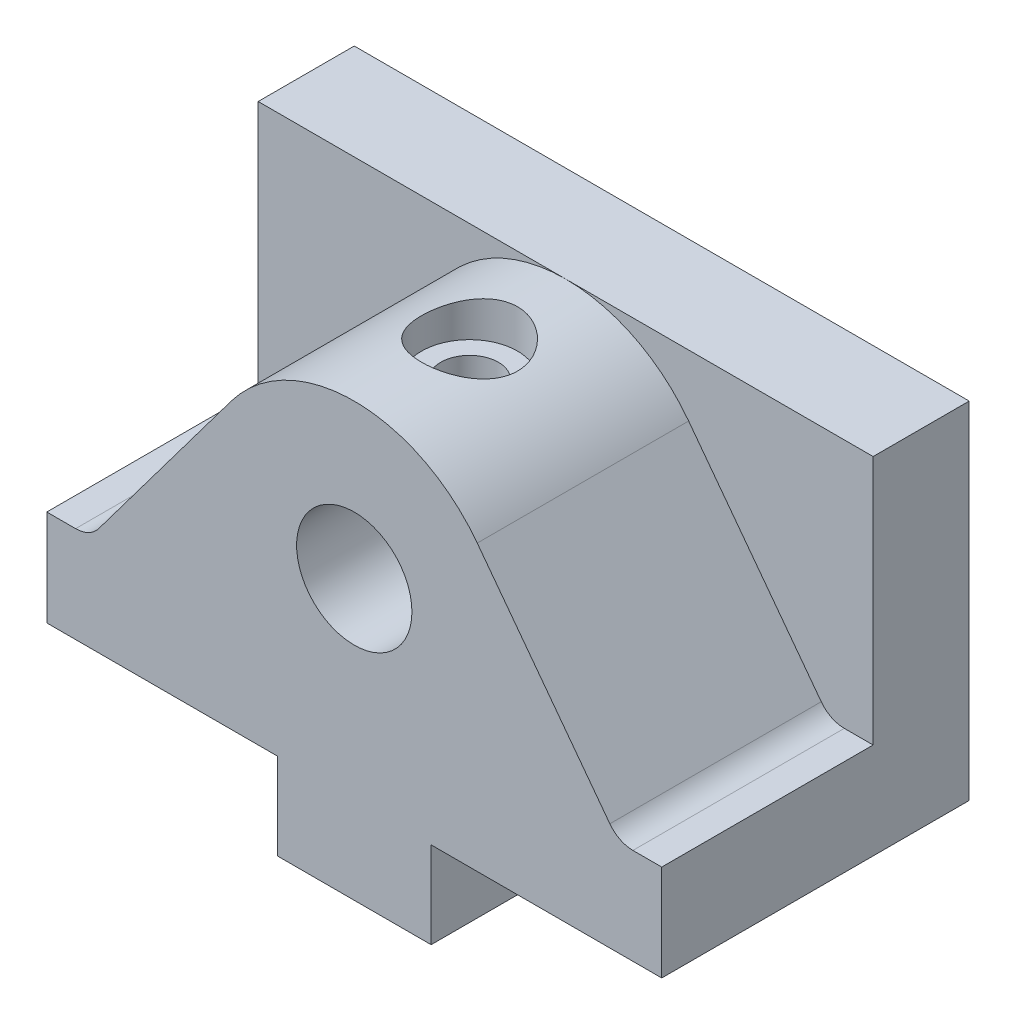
ISO-10303-21;
HEADER;
FILE_DESCRIPTION(('STEP AP214'),'2;1');
FILE_NAME('part.step','',(''),(''),'','','');
FILE_SCHEMA(('AUTOMOTIVE_DESIGN { 1 0 10303 214 1 1 1 1 }'));
ENDSEC;
DATA;
#1=APPLICATION_CONTEXT('core data for automotive mechanical design processes');
#2=APPLICATION_PROTOCOL_DEFINITION('international standard','automotive_design',2000,#1);
#3=PRODUCT_CONTEXT('',#1,'mechanical');
#4=PRODUCT('Part','Part','',(#3));
#5=PRODUCT_RELATED_PRODUCT_CATEGORY('part','',(#4));
#6=PRODUCT_DEFINITION_FORMATION('','',#4);
#7=PRODUCT_DEFINITION_CONTEXT('part definition',#1,'design');
#8=PRODUCT_DEFINITION('design','',#6,#7);
#9=PRODUCT_DEFINITION_SHAPE('','',#8);
#10=(LENGTH_UNIT() NAMED_UNIT(*) SI_UNIT(.MILLI.,.METRE.));
#11=(NAMED_UNIT(*) PLANE_ANGLE_UNIT() SI_UNIT($,.RADIAN.));
#12=(NAMED_UNIT(*) SI_UNIT($,.STERADIAN.) SOLID_ANGLE_UNIT());
#13=UNCERTAINTY_MEASURE_WITH_UNIT(LENGTH_MEASURE(1.E-05),#10,'distance_accuracy_value','');
#14=(GEOMETRIC_REPRESENTATION_CONTEXT(3) GLOBAL_UNCERTAINTY_ASSIGNED_CONTEXT((#13)) GLOBAL_UNIT_ASSIGNED_CONTEXT((#10,
#11,#12)) REPRESENTATION_CONTEXT('',''));
#15=CARTESIAN_POINT('',(0.,0.,0.));
#16=DIRECTION('',(0.,0.,1.));
#17=DIRECTION('',(1.,0.,0.));
#18=AXIS2_PLACEMENT_3D('',#15,#16,#17);
#19=CARTESIAN_POINT('',(8.00000000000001,-23.,32.));
#20=DIRECTION('',(0.,1.,0.));
#21=DIRECTION('',(-1.,0.,0.));
#22=AXIS2_PLACEMENT_3D('',#19,#20,#21);
#23=PLANE('',#22);
#24=CARTESIAN_POINT('',(0.,-23.,24.));
#25=DIRECTION('',(0.,1.,0.));
#26=DIRECTION('',(-1.,0.,0.));
#27=AXIS2_PLACEMENT_3D('',#24,#25,#26);
#28=CIRCLE('',#27,3.);
#29=CARTESIAN_POINT('',(-2.99999999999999,-23.,24.));
#30=VERTEX_POINT('',#29);
#31=EDGE_CURVE('E180',#30,#30,#28,.T.);
#32=ORIENTED_EDGE('',*,*,#31,.T.);
#33=EDGE_LOOP('',(#32));
#34=FACE_BOUND('',#33,.T.);
#35=DIRECTION('',(1.,0.,0.));
#36=VECTOR('',#35,1.);
#37=CARTESIAN_POINT('',(8.00000000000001,-23.,0.));
#38=LINE('',#37,#36);
#39=CARTESIAN_POINT('',(-7.99999999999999,-23.,0.));
#40=VERTEX_POINT('',#39);
#41=CARTESIAN_POINT('',(8.00000000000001,-23.,0.));
#42=VERTEX_POINT('',#41);
#43=EDGE_CURVE('E369',#40,#42,#38,.T.);
#44=ORIENTED_EDGE('',*,*,#43,.T.);
#45=DIRECTION('',(0.,0.,-1.));
#46=VECTOR('',#45,1.);
#47=CARTESIAN_POINT('',(8.00000000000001,-23.,32.));
#48=LINE('',#47,#46);
#49=CARTESIAN_POINT('',(8.00000000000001,-23.,32.));
#50=VERTEX_POINT('',#49);
#51=EDGE_CURVE('E379',#50,#42,#48,.T.);
#52=ORIENTED_EDGE('',*,*,#51,.F.);
#53=DIRECTION('',(1.,0.,0.));
#54=VECTOR('',#53,1.);
#55=CARTESIAN_POINT('',(8.00000000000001,-23.,32.));
#56=LINE('',#55,#54);
#57=CARTESIAN_POINT('',(-7.99999999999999,-23.,32.));
#58=VERTEX_POINT('',#57);
#59=EDGE_CURVE('E351',#58,#50,#56,.T.);
#60=ORIENTED_EDGE('',*,*,#59,.F.);
#61=DIRECTION('',(0.,0.,-1.));
#62=VECTOR('',#61,1.);
#63=CARTESIAN_POINT('',(-7.99999999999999,-23.,32.));
#64=LINE('',#63,#62);
#65=EDGE_CURVE('E382',#58,#40,#64,.T.);
#66=ORIENTED_EDGE('',*,*,#65,.T.);
#67=EDGE_LOOP('',(#44,#52,#60,#66));
#68=FACE_BOUND('',#67,.T.);
#69=CARTESIAN_POINT('',(0.,-23.,8.));
#70=DIRECTION('',(0.,1.,0.));
#71=DIRECTION('',(-1.,0.,0.));
#72=AXIS2_PLACEMENT_3D('',#69,#70,#71);
#73=CIRCLE('',#72,3.);
#74=CARTESIAN_POINT('',(-2.99999999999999,-23.,8.));
#75=VERTEX_POINT('',#74);
#76=EDGE_CURVE('E172',#75,#75,#73,.T.);
#77=ORIENTED_EDGE('',*,*,#76,.T.);
#78=EDGE_LOOP('',(#77));
#79=FACE_BOUND('',#78,.T.);
#80=ADVANCED_FACE('F32',(#34,#68,#79),#23,.F.);
#81=CARTESIAN_POINT('',(32.,22.,32.));
#82=DIRECTION('',(-1.,0.,0.));
#83=DIRECTION('',(0.,-1.,0.));
#84=AXIS2_PLACEMENT_3D('',#81,#82,#83);
#85=PLANE('',#84);
#86=DIRECTION('',(0.,-1.,0.));
#87=VECTOR('',#86,1.);
#88=CARTESIAN_POINT('',(32.,22.,10.));
#89=LINE('',#88,#87);
#90=CARTESIAN_POINT('',(32.,22.,10.));
#91=VERTEX_POINT('',#90);
#92=CARTESIAN_POINT('',(32.,-4.,10.));
#93=VERTEX_POINT('',#92);
#94=EDGE_CURVE('E337',#91,#93,#89,.T.);
#95=ORIENTED_EDGE('',*,*,#94,.T.);
#96=DIRECTION('',(0.,0.,1.));
#97=VECTOR('',#96,1.);
#98=CARTESIAN_POINT('',(32.,-4.,32.));
#99=LINE('',#98,#97);
#100=CARTESIAN_POINT('',(32.,-4.,32.));
#101=VERTEX_POINT('',#100);
#102=EDGE_CURVE('E324',#93,#101,#99,.T.);
#103=ORIENTED_EDGE('',*,*,#102,.T.);
#104=DIRECTION('',(0.,1.,0.));
#105=VECTOR('',#104,1.);
#106=CARTESIAN_POINT('',(32.,22.,32.));
#107=LINE('',#106,#105);
#108=CARTESIAN_POINT('',(32.,-14.,32.));
#109=VERTEX_POINT('',#108);
#110=EDGE_CURVE('E341',#109,#101,#107,.T.);
#111=ORIENTED_EDGE('',*,*,#110,.F.);
#112=DIRECTION('',(0.,0.,-1.));
#113=VECTOR('',#112,1.);
#114=CARTESIAN_POINT('',(32.,-14.,32.));
#115=LINE('',#114,#113);
#116=CARTESIAN_POINT('',(32.,-14.,0.));
#117=VERTEX_POINT('',#116);
#118=EDGE_CURVE('E357',#109,#117,#115,.T.);
#119=ORIENTED_EDGE('',*,*,#118,.T.);
#120=DIRECTION('',(0.,1.,0.));
#121=VECTOR('',#120,1.);
#122=CARTESIAN_POINT('',(32.,22.,0.));
#123=LINE('',#122,#121);
#124=CARTESIAN_POINT('',(32.,22.,0.));
#125=VERTEX_POINT('',#124);
#126=EDGE_CURVE('E340',#117,#125,#123,.T.);
#127=ORIENTED_EDGE('',*,*,#126,.T.);
#128=DIRECTION('',(0.,0.,-1.));
#129=VECTOR('',#128,1.);
#130=CARTESIAN_POINT('',(32.,22.,32.));
#131=LINE('',#130,#129);
#132=EDGE_CURVE('E393',#91,#125,#131,.T.);
#133=ORIENTED_EDGE('',*,*,#132,.F.);
#134=EDGE_LOOP('',(#95,#103,#111,#119,#127,#133));
#135=FACE_BOUND('',#134,.T.);
#136=ADVANCED_FACE('F228',(#135),#85,.F.);
#137=CARTESIAN_POINT('',(-32.,22.,32.));
#138=DIRECTION('',(0.,-1.,0.));
#139=DIRECTION('',(1.,0.,0.));
#140=AXIS2_PLACEMENT_3D('',#137,#138,#139);
#141=PLANE('',#140);
#142=DIRECTION('',(0.,0.,-1.));
#143=VECTOR('',#142,1.);
#144=CARTESIAN_POINT('',(-32.,22.,32.));
#145=LINE('',#144,#143);
#146=CARTESIAN_POINT('',(-32.,22.,10.));
#147=VERTEX_POINT('',#146);
#148=CARTESIAN_POINT('',(-32.,22.,0.));
#149=VERTEX_POINT('',#148);
#150=EDGE_CURVE('E391',#147,#149,#145,.T.);
#151=ORIENTED_EDGE('',*,*,#150,.F.);
#152=DIRECTION('',(1.,0.,0.));
#153=VECTOR('',#152,1.);
#154=CARTESIAN_POINT('',(-32.,22.,10.));
#155=LINE('',#154,#153);
#156=CARTESIAN_POINT('',(0.,22.,10.));
#157=VERTEX_POINT('',#156);
#158=EDGE_CURVE('E333',#147,#157,#155,.T.);
#159=ORIENTED_EDGE('',*,*,#158,.T.);
#160=EDGE_CURVE('E336',#157,#91,#155,.T.);
#161=ORIENTED_EDGE('',*,*,#160,.T.);
#162=ORIENTED_EDGE('',*,*,#132,.T.);
#163=DIRECTION('',(-1.,0.,0.));
#164=VECTOR('',#163,1.);
#165=CARTESIAN_POINT('',(-32.,22.,0.));
#166=LINE('',#165,#164);
#167=EDGE_CURVE('E360',#125,#149,#166,.T.);
#168=ORIENTED_EDGE('',*,*,#167,.T.);
#169=EDGE_LOOP('',(#151,#159,#161,#162,#168));
#170=FACE_BOUND('',#169,.T.);
#171=ADVANCED_FACE('F234',(#170),#141,.F.);
#172=CARTESIAN_POINT('',(-32.,22.,32.));
#173=DIRECTION('',(1.,0.,0.));
#174=DIRECTION('',(0.,1.,0.));
#175=AXIS2_PLACEMENT_3D('',#172,#173,#174);
#176=PLANE('',#175);
#177=DIRECTION('',(0.,-1.,0.));
#178=VECTOR('',#177,1.);
#179=CARTESIAN_POINT('',(-32.,22.,32.));
#180=LINE('',#179,#178);
#181=CARTESIAN_POINT('',(-32.,-4.,32.));
#182=VERTEX_POINT('',#181);
#183=CARTESIAN_POINT('',(-32.,-14.,32.));
#184=VERTEX_POINT('',#183);
#185=EDGE_CURVE('E344',#182,#184,#180,.T.);
#186=ORIENTED_EDGE('',*,*,#185,.F.);
#187=DIRECTION('',(0.,0.,-1.));
#188=VECTOR('',#187,1.);
#189=CARTESIAN_POINT('',(-32.,-4.,32.));
#190=LINE('',#189,#188);
#191=CARTESIAN_POINT('',(-32.,-4.,10.));
#192=VERTEX_POINT('',#191);
#193=EDGE_CURVE('E330',#182,#192,#190,.T.);
#194=ORIENTED_EDGE('',*,*,#193,.T.);
#195=DIRECTION('',(0.,1.,0.));
#196=VECTOR('',#195,1.);
#197=CARTESIAN_POINT('',(-32.,22.,10.));
#198=LINE('',#197,#196);
#199=EDGE_CURVE('E398',#192,#147,#198,.T.);
#200=ORIENTED_EDGE('',*,*,#199,.T.);
#201=ORIENTED_EDGE('',*,*,#150,.T.);
#202=DIRECTION('',(0.,-1.,0.));
#203=VECTOR('',#202,1.);
#204=CARTESIAN_POINT('',(-32.,22.,0.));
#205=LINE('',#204,#203);
#206=CARTESIAN_POINT('',(-32.,-14.,0.));
#207=VERTEX_POINT('',#206);
#208=EDGE_CURVE('E363',#149,#207,#205,.T.);
#209=ORIENTED_EDGE('',*,*,#208,.T.);
#210=DIRECTION('',(0.,0.,-1.));
#211=VECTOR('',#210,1.);
#212=CARTESIAN_POINT('',(-32.,-14.,32.));
#213=LINE('',#212,#211);
#214=EDGE_CURVE('E388',#184,#207,#213,.T.);
#215=ORIENTED_EDGE('',*,*,#214,.F.);
#216=EDGE_LOOP('',(#186,#194,#200,#201,#209,#215));
#217=FACE_BOUND('',#216,.T.);
#218=ADVANCED_FACE('F249',(#217),#176,.F.);
#219=CARTESIAN_POINT('',(-32.,-14.,32.));
#220=DIRECTION('',(0.,1.,0.));
#221=DIRECTION('',(-1.,0.,0.));
#222=AXIS2_PLACEMENT_3D('',#219,#220,#221);
#223=PLANE('',#222);
#224=DIRECTION('',(1.,0.,0.));
#225=VECTOR('',#224,1.);
#226=CARTESIAN_POINT('',(-32.,-14.,0.));
#227=LINE('',#226,#225);
#228=CARTESIAN_POINT('',(-7.99999999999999,-14.,0.));
#229=VERTEX_POINT('',#228);
#230=EDGE_CURVE('E365',#207,#229,#227,.T.);
#231=ORIENTED_EDGE('',*,*,#230,.T.);
#232=DIRECTION('',(0.,0.,-1.));
#233=VECTOR('',#232,1.);
#234=CARTESIAN_POINT('',(-7.99999999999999,-14.,32.));
#235=LINE('',#234,#233);
#236=CARTESIAN_POINT('',(-7.99999999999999,-14.,32.));
#237=VERTEX_POINT('',#236);
#238=EDGE_CURVE('E385',#237,#229,#235,.T.);
#239=ORIENTED_EDGE('',*,*,#238,.F.);
#240=DIRECTION('',(1.,0.,0.));
#241=VECTOR('',#240,1.);
#242=CARTESIAN_POINT('',(-32.,-14.,32.));
#243=LINE('',#242,#241);
#244=EDGE_CURVE('E347',#184,#237,#243,.T.);
#245=ORIENTED_EDGE('',*,*,#244,.F.);
#246=ORIENTED_EDGE('',*,*,#214,.T.);
#247=EDGE_LOOP('',(#231,#239,#245,#246));
#248=FACE_BOUND('',#247,.T.);
#249=ADVANCED_FACE('F245',(#248),#223,.F.);
#250=CARTESIAN_POINT('',(-7.99999999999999,-14.,32.));
#251=DIRECTION('',(1.,0.,0.));
#252=DIRECTION('',(0.,1.,0.));
#253=AXIS2_PLACEMENT_3D('',#250,#251,#252);
#254=PLANE('',#253);
#255=DIRECTION('',(0.,-1.,0.));
#256=VECTOR('',#255,1.);
#257=CARTESIAN_POINT('',(-7.99999999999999,-14.,0.));
#258=LINE('',#257,#256);
#259=EDGE_CURVE('E367',#229,#40,#258,.T.);
#260=ORIENTED_EDGE('',*,*,#259,.T.);
#261=ORIENTED_EDGE('',*,*,#65,.F.);
#262=DIRECTION('',(0.,-1.,0.));
#263=VECTOR('',#262,1.);
#264=CARTESIAN_POINT('',(-7.99999999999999,-14.,32.));
#265=LINE('',#264,#263);
#266=EDGE_CURVE('E349',#237,#58,#265,.T.);
#267=ORIENTED_EDGE('',*,*,#266,.F.);
#268=ORIENTED_EDGE('',*,*,#238,.T.);
#269=EDGE_LOOP('',(#260,#261,#267,#268));
#270=FACE_BOUND('',#269,.T.);
#271=ADVANCED_FACE('F242',(#270),#254,.F.);
#272=CARTESIAN_POINT('',(8.00000000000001,-14.,32.));
#273=DIRECTION('',(-1.,0.,0.));
#274=DIRECTION('',(0.,-1.,0.));
#275=AXIS2_PLACEMENT_3D('',#272,#273,#274);
#276=PLANE('',#275);
#277=DIRECTION('',(0.,1.,0.));
#278=VECTOR('',#277,1.);
#279=CARTESIAN_POINT('',(8.00000000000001,-14.,0.));
#280=LINE('',#279,#278);
#281=CARTESIAN_POINT('',(8.00000000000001,-14.,0.));
#282=VERTEX_POINT('',#281);
#283=EDGE_CURVE('E371',#42,#282,#280,.T.);
#284=ORIENTED_EDGE('',*,*,#283,.T.);
#285=DIRECTION('',(0.,0.,-1.));
#286=VECTOR('',#285,1.);
#287=CARTESIAN_POINT('',(8.00000000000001,-14.,32.));
#288=LINE('',#287,#286);
#289=CARTESIAN_POINT('',(8.00000000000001,-14.,32.));
#290=VERTEX_POINT('',#289);
#291=EDGE_CURVE('E376',#290,#282,#288,.T.);
#292=ORIENTED_EDGE('',*,*,#291,.F.);
#293=DIRECTION('',(0.,1.,0.));
#294=VECTOR('',#293,1.);
#295=CARTESIAN_POINT('',(8.00000000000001,-14.,32.));
#296=LINE('',#295,#294);
#297=EDGE_CURVE('E353',#50,#290,#296,.T.);
#298=ORIENTED_EDGE('',*,*,#297,.F.);
#299=ORIENTED_EDGE('',*,*,#51,.T.);
#300=EDGE_LOOP('',(#284,#292,#298,#299));
#301=FACE_BOUND('',#300,.T.);
#302=ADVANCED_FACE('F240',(#301),#276,.F.);
#303=CARTESIAN_POINT('',(32.,-14.,32.));
#304=DIRECTION('',(0.,1.,0.));
#305=DIRECTION('',(-1.,0.,0.));
#306=AXIS2_PLACEMENT_3D('',#303,#304,#305);
#307=PLANE('',#306);
#308=DIRECTION('',(1.,0.,0.));
#309=VECTOR('',#308,1.);
#310=CARTESIAN_POINT('',(32.,-14.,0.));
#311=LINE('',#310,#309);
#312=EDGE_CURVE('E345',#282,#117,#311,.T.);
#313=ORIENTED_EDGE('',*,*,#312,.T.);
#314=ORIENTED_EDGE('',*,*,#118,.F.);
#315=DIRECTION('',(1.,0.,0.));
#316=VECTOR('',#315,1.);
#317=CARTESIAN_POINT('',(32.,-14.,32.));
#318=LINE('',#317,#316);
#319=EDGE_CURVE('E355',#290,#109,#318,.T.);
#320=ORIENTED_EDGE('',*,*,#319,.F.);
#321=ORIENTED_EDGE('',*,*,#291,.T.);
#322=EDGE_LOOP('',(#313,#314,#320,#321));
#323=FACE_BOUND('',#322,.T.);
#324=ADVANCED_FACE('F305',(#323),#307,.F.);
#325=CARTESIAN_POINT('',(32.,-23.,32.));
#326=DIRECTION('',(0.,0.,-1.));
#327=DIRECTION('',(-1.,0.,0.));
#328=AXIS2_PLACEMENT_3D('',#325,#326,#327);
#329=PLANE('',#328);
#330=CARTESIAN_POINT('',(0.,6.,32.));
#331=DIRECTION('',(0.,0.,1.));
#332=DIRECTION('',(1.,0.,0.));
#333=AXIS2_PLACEMENT_3D('',#330,#331,#332);
#334=CIRCLE('',#333,6.);
#335=CARTESIAN_POINT('',(6.,6.,32.));
#336=VERTEX_POINT('',#335);
#337=EDGE_CURVE('E197',#336,#336,#334,.T.);
#338=ORIENTED_EDGE('',*,*,#337,.F.);
#339=EDGE_LOOP('',(#338));
#340=FACE_BOUND('',#339,.T.);
#341=DIRECTION('',(0.6,0.8,0.));
#342=VECTOR('',#341,1.);
#343=CARTESIAN_POINT('',(-12.8,15.6,32.));
#344=LINE('',#343,#342);
#345=CARTESIAN_POINT('',(-26.6,-2.80000000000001,32.));
#346=VERTEX_POINT('',#345);
#347=CARTESIAN_POINT('',(-12.8,15.6,32.));
#348=VERTEX_POINT('',#347);
#349=EDGE_CURVE('E309',#346,#348,#344,.T.);
#350=ORIENTED_EDGE('',*,*,#349,.F.);
#351=CARTESIAN_POINT('',(-29.,-1.00000000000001,32.));
#352=DIRECTION('',(0.,0.,-1.));
#353=DIRECTION('',(-1.,0.,0.));
#354=AXIS2_PLACEMENT_3D('',#351,#352,#353);
#355=CIRCLE('',#354,3.);
#356=CARTESIAN_POINT('',(-29.,-4.00000000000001,32.));
#357=VERTEX_POINT('',#356);
#358=EDGE_CURVE('E287',#346,#357,#355,.T.);
#359=ORIENTED_EDGE('',*,*,#358,.T.);
#360=DIRECTION('',(-1.,0.,0.));
#361=VECTOR('',#360,1.);
#362=CARTESIAN_POINT('',(32.,-4.00000000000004,32.));
#363=LINE('',#362,#361);
#364=EDGE_CURVE('E396',#357,#182,#363,.T.);
#365=ORIENTED_EDGE('',*,*,#364,.T.);
#366=ORIENTED_EDGE('',*,*,#185,.T.);
#367=ORIENTED_EDGE('',*,*,#244,.T.);
#368=ORIENTED_EDGE('',*,*,#266,.T.);
#369=ORIENTED_EDGE('',*,*,#59,.T.);
#370=ORIENTED_EDGE('',*,*,#297,.T.);
#371=ORIENTED_EDGE('',*,*,#319,.T.);
#372=ORIENTED_EDGE('',*,*,#110,.T.);
#373=DIRECTION('',(1.,0.,0.));
#374=VECTOR('',#373,1.);
#375=CARTESIAN_POINT('',(38.9732794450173,-4.,32.));
#376=LINE('',#375,#374);
#377=CARTESIAN_POINT('',(29.,-4.,32.));
#378=VERTEX_POINT('',#377);
#379=EDGE_CURVE('E295',#378,#101,#376,.T.);
#380=ORIENTED_EDGE('',*,*,#379,.F.);
#381=CARTESIAN_POINT('',(29.,-0.999999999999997,32.));
#382=DIRECTION('',(0.,0.,-1.));
#383=DIRECTION('',(-1.,0.,0.));
#384=AXIS2_PLACEMENT_3D('',#381,#382,#383);
#385=CIRCLE('',#384,3.);
#386=CARTESIAN_POINT('',(26.6,-2.8,32.));
#387=VERTEX_POINT('',#386);
#388=EDGE_CURVE('E289',#378,#387,#385,.T.);
#389=ORIENTED_EDGE('',*,*,#388,.T.);
#390=DIRECTION('',(0.6,-0.8,0.));
#391=VECTOR('',#390,1.);
#392=CARTESIAN_POINT('',(12.8,15.6,32.));
#393=LINE('',#392,#391);
#394=CARTESIAN_POINT('',(12.8,15.6,32.));
#395=VERTEX_POINT('',#394);
#396=EDGE_CURVE('E292',#395,#387,#393,.T.);
#397=ORIENTED_EDGE('',*,*,#396,.F.);
#398=CARTESIAN_POINT('',(0.,6.,32.));
#399=DIRECTION('',(0.,0.,-1.));
#400=DIRECTION('',(-1.,0.,0.));
#401=AXIS2_PLACEMENT_3D('',#398,#399,#400);
#402=CIRCLE('',#401,16.);
#403=EDGE_CURVE('E313',#395,#348,#402,.F.);
#404=ORIENTED_EDGE('',*,*,#403,.T.);
#405=EDGE_LOOP('',(#350,#359,#365,#366,#367,#368,#369,#370,#371,#372,#380,#389,#397,#404));
#406=FACE_BOUND('',#405,.T.);
#407=ADVANCED_FACE('F301',(#340,#406),#329,.F.);
#408=CARTESIAN_POINT('',(32.,-23.,0.));
#409=DIRECTION('',(0.,0.,-1.));
#410=DIRECTION('',(-1.,0.,0.));
#411=AXIS2_PLACEMENT_3D('',#408,#409,#410);
#412=PLANE('',#411);
#413=CARTESIAN_POINT('',(0.,6.,0.));
#414=DIRECTION('',(0.,0.,-1.));
#415=DIRECTION('',(-1.,0.,0.));
#416=AXIS2_PLACEMENT_3D('',#413,#414,#415);
#417=CIRCLE('',#416,6.);
#418=CARTESIAN_POINT('',(-6.,6.,0.));
#419=VERTEX_POINT('',#418);
#420=EDGE_CURVE('E290',#419,#419,#417,.T.);
#421=ORIENTED_EDGE('',*,*,#420,.F.);
#422=EDGE_LOOP('',(#421));
#423=FACE_BOUND('',#422,.T.);
#424=ORIENTED_EDGE('',*,*,#126,.F.);
#425=ORIENTED_EDGE('',*,*,#312,.F.);
#426=ORIENTED_EDGE('',*,*,#283,.F.);
#427=ORIENTED_EDGE('',*,*,#43,.F.);
#428=ORIENTED_EDGE('',*,*,#259,.F.);
#429=ORIENTED_EDGE('',*,*,#230,.F.);
#430=ORIENTED_EDGE('',*,*,#208,.F.);
#431=ORIENTED_EDGE('',*,*,#167,.F.);
#432=EDGE_LOOP('',(#424,#425,#426,#427,#428,#429,#430,#431));
#433=FACE_BOUND('',#432,.T.);
#434=ADVANCED_FACE('F304',(#423,#433),#412,.T.);
#435=CARTESIAN_POINT('',(0.,6.,10.));
#436=DIRECTION('',(0.,0.,-1.));
#437=DIRECTION('',(-1.,0.,0.));
#438=AXIS2_PLACEMENT_3D('',#435,#436,#437);
#439=PLANE('',#438);
#440=DIRECTION('',(0.6,-0.8,0.));
#441=VECTOR('',#440,1.);
#442=CARTESIAN_POINT('',(12.8,15.6,10.));
#443=LINE('',#442,#441);
#444=CARTESIAN_POINT('',(12.8,15.6,10.));
#445=VERTEX_POINT('',#444);
#446=CARTESIAN_POINT('',(26.6,-2.8,10.));
#447=VERTEX_POINT('',#446);
#448=EDGE_CURVE('E408',#445,#447,#443,.T.);
#449=ORIENTED_EDGE('',*,*,#448,.T.);
#450=CARTESIAN_POINT('',(29.,-0.999999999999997,10.));
#451=DIRECTION('',(0.,0.,-1.));
#452=DIRECTION('',(-1.,0.,0.));
#453=AXIS2_PLACEMENT_3D('',#450,#451,#452);
#454=CIRCLE('',#453,3.);
#455=CARTESIAN_POINT('',(29.,-4.,10.));
#456=VERTEX_POINT('',#455);
#457=EDGE_CURVE('E285',#447,#456,#454,.F.);
#458=ORIENTED_EDGE('',*,*,#457,.T.);
#459=DIRECTION('',(1.,0.,0.));
#460=VECTOR('',#459,1.);
#461=CARTESIAN_POINT('',(27.5,-4.,10.));
#462=LINE('',#461,#460);
#463=EDGE_CURVE('E404',#456,#93,#462,.T.);
#464=ORIENTED_EDGE('',*,*,#463,.T.);
#465=ORIENTED_EDGE('',*,*,#94,.F.);
#466=ORIENTED_EDGE('',*,*,#160,.F.);
#467=CARTESIAN_POINT('',(0.,6.,10.));
#468=DIRECTION('',(0.,0.,-1.));
#469=DIRECTION('',(-1.,0.,0.));
#470=AXIS2_PLACEMENT_3D('',#467,#468,#469);
#471=CIRCLE('',#470,16.);
#472=EDGE_CURVE('E317',#157,#445,#471,.T.);
#473=ORIENTED_EDGE('',*,*,#472,.T.);
#474=EDGE_LOOP('',(#449,#458,#464,#465,#466,#473));
#475=FACE_BOUND('',#474,.T.);
#476=ADVANCED_FACE('F459',(#475),#439,.F.);
#477=DIRECTION('',(1.,0.,0.));
#478=VECTOR('',#477,1.);
#479=CARTESIAN_POINT('',(-32.,-4.,10.));
#480=LINE('',#479,#478);
#481=CARTESIAN_POINT('',(-29.,-4.,10.));
#482=VERTEX_POINT('',#481);
#483=EDGE_CURVE('E402',#192,#482,#480,.T.);
#484=ORIENTED_EDGE('',*,*,#483,.T.);
#485=CARTESIAN_POINT('',(-29.,-1.00000000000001,10.));
#486=DIRECTION('',(0.,0.,-1.));
#487=DIRECTION('',(-1.,0.,0.));
#488=AXIS2_PLACEMENT_3D('',#485,#486,#487);
#489=CIRCLE('',#488,3.);
#490=CARTESIAN_POINT('',(-26.6,-2.80000000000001,10.));
#491=VERTEX_POINT('',#490);
#492=EDGE_CURVE('E270',#482,#491,#489,.F.);
#493=ORIENTED_EDGE('',*,*,#492,.T.);
#494=DIRECTION('',(0.6,0.8,0.));
#495=VECTOR('',#494,1.);
#496=CARTESIAN_POINT('',(-12.8,15.6,10.));
#497=LINE('',#496,#495);
#498=CARTESIAN_POINT('',(-12.8,15.6,10.));
#499=VERTEX_POINT('',#498);
#500=EDGE_CURVE('E327',#491,#499,#497,.T.);
#501=ORIENTED_EDGE('',*,*,#500,.T.);
#502=EDGE_CURVE('E319',#499,#157,#471,.T.);
#503=ORIENTED_EDGE('',*,*,#502,.T.);
#504=ORIENTED_EDGE('',*,*,#158,.F.);
#505=ORIENTED_EDGE('',*,*,#199,.F.);
#506=EDGE_LOOP('',(#484,#493,#501,#503,#504,#505));
#507=FACE_BOUND('',#506,.T.);
#508=ADVANCED_FACE('F409',(#507),#439,.F.);
#509=CARTESIAN_POINT('',(0.,6.,10.));
#510=DIRECTION('',(0.,0.,1.));
#511=DIRECTION('',(1.,0.,0.));
#512=AXIS2_PLACEMENT_3D('',#509,#510,#511);
#513=CYLINDRICAL_SURFACE('',#512,16.);
#514=CARTESIAN_POINT('',(0.,22.,25.));
#515=CARTESIAN_POINT('',(-0.273756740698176,21.9999986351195,24.9999982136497));
#516=CARTESIAN_POINT('',(-0.547532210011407,21.9929077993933,24.9774430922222));
#517=CARTESIAN_POINT('',(-1.08707683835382,21.9653157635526,24.888055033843));
#518=CARTESIAN_POINT('',(-1.35284417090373,21.9448115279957,24.8212120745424));
#519=CARTESIAN_POINT('',(-1.86851417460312,21.892632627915,24.6457225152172));
#520=CARTESIAN_POINT('',(-2.11844070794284,21.860975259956,24.5371406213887));
#521=CARTESIAN_POINT('',(-2.59653920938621,21.7897587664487,24.2815307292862));
#522=CARTESIAN_POINT('',(-2.82470774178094,21.7501983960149,24.1344966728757));
#523=CARTESIAN_POINT('',(-3.25986133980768,21.6660085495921,23.8013760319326));
#524=CARTESIAN_POINT('',(-3.46608011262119,21.621268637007,23.6143164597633));
#525=CARTESIAN_POINT('',(-3.84478952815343,21.5324018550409,23.2085264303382));
#526=CARTESIAN_POINT('',(-4.01727389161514,21.4882751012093,22.9897900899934));
#527=CARTESIAN_POINT('',(-4.32777345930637,21.4044457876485,22.5202217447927));
#528=CARTESIAN_POINT('',(-4.4648313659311,21.3648795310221,22.2687300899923));
#529=CARTESIAN_POINT('',(-4.69438964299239,21.2963120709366,21.7448307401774));
#530=CARTESIAN_POINT('',(-4.78690175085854,21.2673080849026,21.4724285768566));
#531=CARTESIAN_POINT('',(-4.92193839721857,21.224304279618,20.9230876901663));
#532=CARTESIAN_POINT('',(-4.96588440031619,21.2098789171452,20.6465326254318));
#533=CARTESIAN_POINT('',(-5.00698220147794,21.1964022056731,20.0896275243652));
#534=CARTESIAN_POINT('',(-5.00414643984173,21.1973467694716,19.809278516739));
#535=CARTESIAN_POINT('',(-4.95287298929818,21.2141275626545,19.2645021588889));
#536=CARTESIAN_POINT('',(-4.90624231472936,21.2293736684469,18.9998834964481));
#537=CARTESIAN_POINT('',(-4.77163253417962,21.272081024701,18.482431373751));
#538=CARTESIAN_POINT('',(-4.68364903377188,21.2995435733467,18.2295991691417));
#539=CARTESIAN_POINT('',(-4.46755498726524,21.3640417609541,17.7385922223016));
#540=CARTESIAN_POINT('',(-4.33887702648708,21.4012113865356,17.5006855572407));
#541=CARTESIAN_POINT('',(-4.04544082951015,21.4808742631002,17.0492489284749));
#542=CARTESIAN_POINT('',(-3.88067322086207,21.523368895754,16.8357253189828));
#543=CARTESIAN_POINT('',(-3.5108678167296,21.6112611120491,16.4289002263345));
#544=CARTESIAN_POINT('',(-3.30433828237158,21.6567027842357,16.2369617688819));
#545=CARTESIAN_POINT('',(-2.86145763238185,21.7436628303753,15.8901124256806));
#546=CARTESIAN_POINT('',(-2.62510430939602,21.7851809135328,15.735204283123));
#547=CARTESIAN_POINT('',(-2.12665844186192,21.8600517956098,15.4658892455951));
#548=CARTESIAN_POINT('',(-1.86437962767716,21.8933384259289,15.3518074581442));
#549=CARTESIAN_POINT('',(-1.32307191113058,21.9475182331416,15.1697879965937));
#550=CARTESIAN_POINT('',(-1.04404812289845,21.9684151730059,15.1018363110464));
#551=CARTESIAN_POINT('',(-0.48874062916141,21.9948555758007,15.0163278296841));
#552=CARTESIAN_POINT('',(-0.212767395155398,22.0009609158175,14.9969258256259));
#553=CARTESIAN_POINT('',(0.338521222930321,21.9987919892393,15.0038649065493));
#554=CARTESIAN_POINT('',(0.613836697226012,21.9905198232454,15.0301993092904));
#555=CARTESIAN_POINT('',(1.14887733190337,21.9608945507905,15.1263823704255));
#556=CARTESIAN_POINT('',(1.40881991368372,21.9398717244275,15.1951330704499));
#557=CARTESIAN_POINT('',(1.91340771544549,21.8872048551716,15.3728574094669));
#558=CARTESIAN_POINT('',(2.15805104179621,21.8555595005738,15.4818360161));
#559=CARTESIAN_POINT('',(2.63172962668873,21.783941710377,15.7398928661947));
#560=CARTESIAN_POINT('',(2.86023895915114,21.7437850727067,15.8898839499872));
#561=CARTESIAN_POINT('',(3.28946340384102,21.6597364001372,16.2246128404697));
#562=CARTESIAN_POINT('',(3.49017095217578,21.6158433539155,16.4093600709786));
#563=CARTESIAN_POINT('',(3.86634985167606,21.5270797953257,16.8170355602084));
#564=CARTESIAN_POINT('',(4.04050609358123,21.4822394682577,17.0411866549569));
#565=CARTESIAN_POINT('',(4.34885000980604,21.3984778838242,17.5165064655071));
#566=CARTESIAN_POINT('',(4.48303831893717,21.3595565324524,17.7676747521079));
#567=CARTESIAN_POINT('',(4.70680333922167,21.2924712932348,18.2893806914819));
#568=CARTESIAN_POINT('',(4.79655278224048,21.264265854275,18.5598385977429));
#569=CARTESIAN_POINT('',(4.92891577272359,21.2220468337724,19.1130899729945));
#570=CARTESIAN_POINT('',(4.97154725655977,21.2080278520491,19.3958787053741));
#571=CARTESIAN_POINT('',(5.00717624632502,21.1963317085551,19.9520163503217));
#572=CARTESIAN_POINT('',(5.00233118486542,21.1979441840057,20.2252138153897));
#573=CARTESIAN_POINT('',(4.94835272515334,21.2156036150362,20.7666983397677));
#574=CARTESIAN_POINT('',(4.89922139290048,21.2316498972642,21.0349856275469));
#575=CARTESIAN_POINT('',(4.75950919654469,21.2758725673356,21.5551761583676));
#576=CARTESIAN_POINT('',(4.66954569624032,21.3038679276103,21.8072617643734));
#577=CARTESIAN_POINT('',(4.45120909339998,21.3687881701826,22.292961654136));
#578=CARTESIAN_POINT('',(4.32282817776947,21.4057148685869,22.5265721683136));
#579=CARTESIAN_POINT('',(4.02542700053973,21.4861394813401,22.9785838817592));
#580=CARTESIAN_POINT('',(3.85501334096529,21.5298379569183,23.1960325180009));
#581=CARTESIAN_POINT('',(3.48083598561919,21.6179599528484,23.599945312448));
#582=CARTESIAN_POINT('',(3.27706336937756,21.6623836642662,23.7864011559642));
#583=CARTESIAN_POINT('',(2.83394665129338,21.7486908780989,24.1291301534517));
#584=CARTESIAN_POINT('',(2.59365829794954,21.7904440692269,24.2842189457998));
#585=CARTESIAN_POINT('',(2.0891165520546,21.8650707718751,24.5515956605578));
#586=CARTESIAN_POINT('',(1.8248726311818,21.8979477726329,24.6639004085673));
#587=CARTESIAN_POINT('',(1.30299054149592,21.9488260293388,24.8343654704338));
#588=CARTESIAN_POINT('',(1.04668134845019,21.9678496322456,24.8962994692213));
#589=CARTESIAN_POINT('',(0.526919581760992,21.9934360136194,24.9791134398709));
#590=CARTESIAN_POINT('',(0.263468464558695,22.0000013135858,25.000001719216));
#591=CARTESIAN_POINT('',(0.,22.,25.));
#592=B_SPLINE_CURVE_WITH_KNOTS('',3,(#514,#515,#516,#517,#518,#519,#520,#521,#522,#523,#524,
#525,#526,#527,#528,#529,#530,#531,#532,#533,#534,#535,#536,#537,#538,#539,#540,#541,#542,#543,
#544,#545,#546,#547,#548,#549,#550,#551,#552,#553,#554,#555,#556,#557,#558,#559,#560,#561,#562,
#563,#564,#565,#566,#567,#568,#569,#570,#571,#572,#573,#574,#575,#576,#577,#578,#579,#580,#581,
#582,#583,#584,#585,#586,#587,#588,#589,#590,#591),.UNSPECIFIED.,.T.,.F.,(4,2,2,2,2,2,2,2,2,2,2,
2,2,2,2,2,2,2,2,2,2,2,2,2,2,2,2,2,2,2,2,2,2,2,2,2,2,2,4),(0.,0.82030179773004,1.64078929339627,
2.46000991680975,3.27935968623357,4.12151288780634,4.96382269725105,5.82695084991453,
6.68985145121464,7.52676600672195,8.36345801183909,9.16707669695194,9.97078079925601,
10.7862257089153,11.6018826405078,12.4546698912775,13.3075202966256,14.1670184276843,
15.0262553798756,15.852302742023,16.678229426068,17.4836250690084,18.2891202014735,
19.1142529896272,19.9396098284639,20.7976711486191,21.655718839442,22.5104046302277,
23.3647649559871,24.1804881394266,24.9961732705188,25.7999165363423,26.6038233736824,
27.4391805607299,28.274761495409,29.1376267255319,30.0001522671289,30.789785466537,
31.5792588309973),.UNSPECIFIED.);
#593=CARTESIAN_POINT('',(0.,22.,15.));
#594=VERTEX_POINT('',#593);
#595=CARTESIAN_POINT('',(0.,22.,25.));
#596=VERTEX_POINT('',#595);
#597=EDGE_CURVE('E36',#594,#596,#592,.T.);
#598=ORIENTED_EDGE('',*,*,#597,.T.);
#599=EDGE_CURVE('E11',#596,#594,#592,.T.);
#600=ORIENTED_EDGE('',*,*,#599,.T.);
#601=EDGE_LOOP('',(#598,#600));
#602=FACE_BOUND('',#601,.T.);
#603=ORIENTED_EDGE('',*,*,#403,.F.);
#604=DIRECTION('',(0.,0.,1.));
#605=VECTOR('',#604,1.);
#606=CARTESIAN_POINT('',(12.8,15.6,10.));
#607=LINE('',#606,#605);
#608=EDGE_CURVE('E325',#445,#395,#607,.T.);
#609=ORIENTED_EDGE('',*,*,#608,.F.);
#610=ORIENTED_EDGE('',*,*,#472,.F.);
#611=ORIENTED_EDGE('',*,*,#502,.F.);
#612=DIRECTION('',(0.,0.,1.));
#613=VECTOR('',#612,1.);
#614=CARTESIAN_POINT('',(-12.8,15.6,10.));
#615=LINE('',#614,#613);
#616=EDGE_CURVE('E322',#499,#348,#615,.T.);
#617=ORIENTED_EDGE('',*,*,#616,.T.);
#618=EDGE_LOOP('',(#603,#609,#610,#611,#617));
#619=FACE_BOUND('',#618,.T.);
#620=ADVANCED_FACE('F451',(#602,#619),#513,.T.);
#621=CARTESIAN_POINT('',(-27.5,-4.00000000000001,10.));
#622=DIRECTION('',(0.,-1.,0.));
#623=DIRECTION('',(1.,0.,0.));
#624=AXIS2_PLACEMENT_3D('',#621,#622,#623);
#625=PLANE('',#624);
#626=ORIENTED_EDGE('',*,*,#364,.F.);
#627=DIRECTION('',(0.,0.,1.));
#628=VECTOR('',#627,1.);
#629=CARTESIAN_POINT('',(-29.,-4.00000000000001,10.));
#630=LINE('',#629,#628);
#631=EDGE_CURVE('E271',#357,#482,#630,.F.);
#632=ORIENTED_EDGE('',*,*,#631,.T.);
#633=ORIENTED_EDGE('',*,*,#483,.F.);
#634=ORIENTED_EDGE('',*,*,#193,.F.);
#635=EDGE_LOOP('',(#626,#632,#633,#634));
#636=FACE_BOUND('',#635,.T.);
#637=ADVANCED_FACE('F422',(#636),#625,.F.);
#638=CARTESIAN_POINT('',(38.9732794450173,-4.,10.));
#639=DIRECTION('',(0.,-1.,0.));
#640=DIRECTION('',(0.,0.,-1.));
#641=AXIS2_PLACEMENT_3D('',#638,#639,#640);
#642=PLANE('',#641);
#643=ORIENTED_EDGE('',*,*,#463,.F.);
#644=DIRECTION('',(0.,0.,1.));
#645=VECTOR('',#644,1.);
#646=CARTESIAN_POINT('',(29.,-4.,32.));
#647=LINE('',#646,#645);
#648=EDGE_CURVE('E277',#456,#378,#647,.T.);
#649=ORIENTED_EDGE('',*,*,#648,.T.);
#650=ORIENTED_EDGE('',*,*,#379,.T.);
#651=ORIENTED_EDGE('',*,*,#102,.F.);
#652=EDGE_LOOP('',(#643,#649,#650,#651));
#653=FACE_BOUND('',#652,.T.);
#654=ADVANCED_FACE('F447',(#653),#642,.F.);
#655=CARTESIAN_POINT('',(-12.8,15.6,10.));
#656=DIRECTION('',(0.8,-0.6,0.));
#657=DIRECTION('',(0.6,0.8,0.));
#658=AXIS2_PLACEMENT_3D('',#655,#656,#657);
#659=PLANE('',#658);
#660=ORIENTED_EDGE('',*,*,#500,.F.);
#661=DIRECTION('',(0.,0.,1.));
#662=VECTOR('',#661,1.);
#663=CARTESIAN_POINT('',(-26.6,-2.80000000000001,32.));
#664=LINE('',#663,#662);
#665=EDGE_CURVE('E273',#491,#346,#664,.T.);
#666=ORIENTED_EDGE('',*,*,#665,.T.);
#667=ORIENTED_EDGE('',*,*,#349,.T.);
#668=ORIENTED_EDGE('',*,*,#616,.F.);
#669=EDGE_LOOP('',(#660,#666,#667,#668));
#670=FACE_BOUND('',#669,.T.);
#671=ADVANCED_FACE('F265',(#670),#659,.F.);
#672=CARTESIAN_POINT('',(12.8,15.6,10.));
#673=DIRECTION('',(-0.8,-0.6,0.));
#674=DIRECTION('',(0.6,-0.8,0.));
#675=AXIS2_PLACEMENT_3D('',#672,#673,#674);
#676=PLANE('',#675);
#677=ORIENTED_EDGE('',*,*,#396,.T.);
#678=DIRECTION('',(0.,0.,1.));
#679=VECTOR('',#678,1.);
#680=CARTESIAN_POINT('',(26.6,-2.8,10.));
#681=LINE('',#680,#679);
#682=EDGE_CURVE('E57',#387,#447,#681,.F.);
#683=ORIENTED_EDGE('',*,*,#682,.T.);
#684=ORIENTED_EDGE('',*,*,#448,.F.);
#685=ORIENTED_EDGE('',*,*,#608,.T.);
#686=EDGE_LOOP('',(#677,#683,#684,#685));
#687=FACE_BOUND('',#686,.T.);
#688=ADVANCED_FACE('F258',(#687),#676,.F.);
#689=CARTESIAN_POINT('',(-29.,-1.00000000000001,10.));
#690=DIRECTION('',(0.,0.,-1.));
#691=DIRECTION('',(-1.,0.,0.));
#692=AXIS2_PLACEMENT_3D('',#689,#690,#691);
#693=CYLINDRICAL_SURFACE('',#692,3.);
#694=ORIENTED_EDGE('',*,*,#492,.F.);
#695=ORIENTED_EDGE('',*,*,#631,.F.);
#696=ORIENTED_EDGE('',*,*,#358,.F.);
#697=ORIENTED_EDGE('',*,*,#665,.F.);
#698=EDGE_LOOP('',(#694,#695,#696,#697));
#699=FACE_BOUND('',#698,.T.);
#700=ADVANCED_FACE('F256',(#699),#693,.F.);
#701=CARTESIAN_POINT('',(29.,-0.999999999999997,10.));
#702=DIRECTION('',(0.,0.,-1.));
#703=DIRECTION('',(-1.,0.,0.));
#704=AXIS2_PLACEMENT_3D('',#701,#702,#703);
#705=CYLINDRICAL_SURFACE('',#704,3.);
#706=ORIENTED_EDGE('',*,*,#457,.F.);
#707=ORIENTED_EDGE('',*,*,#682,.F.);
#708=ORIENTED_EDGE('',*,*,#388,.F.);
#709=ORIENTED_EDGE('',*,*,#648,.F.);
#710=EDGE_LOOP('',(#706,#707,#708,#709));
#711=FACE_BOUND('',#710,.T.);
#712=ADVANCED_FACE('F34',(#711),#705,.F.);
#713=CARTESIAN_POINT('',(0.,6.,-29.));
#714=DIRECTION('',(0.,0.,1.));
#715=DIRECTION('',(1.,0.,0.));
#716=AXIS2_PLACEMENT_3D('',#713,#714,#715);
#717=CYLINDRICAL_SURFACE('',#716,6.);
#718=CARTESIAN_POINT('',(0.,12.,23.));
#719=CARTESIAN_POINT('',(0.0788941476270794,11.9999993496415,22.9999991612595));
#720=CARTESIAN_POINT('',(0.157796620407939,11.9984386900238,22.9968820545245));
#721=CARTESIAN_POINT('',(0.315001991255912,11.9922435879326,22.98446072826));
#722=CARTESIAN_POINT('',(0.393304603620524,11.987607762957,22.9751537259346));
#723=CARTESIAN_POINT('',(0.626628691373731,11.9692197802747,22.9380421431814));
#724=CARTESIAN_POINT('',(0.77995289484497,11.950987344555,22.9010471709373));
#725=CARTESIAN_POINT('',(1.07683586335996,11.9044896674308,22.8044182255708));
#726=CARTESIAN_POINT('',(1.22043005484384,11.8762634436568,22.7448722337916));
#727=CARTESIAN_POINT('',(1.49540820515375,11.8123730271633,22.6052887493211));
#728=CARTESIAN_POINT('',(1.62679312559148,11.7767094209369,22.5252528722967));
#729=CARTESIAN_POINT('',(1.88252701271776,11.6986875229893,22.3414460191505));
#730=CARTESIAN_POINT('',(2.00596945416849,11.6560547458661,22.2365320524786));
#731=CARTESIAN_POINT('',(2.23433451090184,11.5698003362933,22.0084440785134));
#732=CARTESIAN_POINT('',(2.33924301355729,11.5261779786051,21.8852562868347));
#733=CARTESIAN_POINT('',(2.53576864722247,11.4389634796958,21.6125156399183));
#734=CARTESIAN_POINT('',(2.625724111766,11.3956360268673,21.4616590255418));
#735=CARTESIAN_POINT('',(2.74034031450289,11.337824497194,21.2240491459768));
#736=CARTESIAN_POINT('',(2.77516786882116,11.3197457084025,21.1429290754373));
#737=CARTESIAN_POINT('',(2.83769299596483,11.2866576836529,20.9773994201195));
#738=CARTESIAN_POINT('',(2.86539478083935,11.2716466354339,20.8929918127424));
#739=CARTESIAN_POINT('',(2.91188280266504,11.2461034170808,20.7266042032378));
#740=CARTESIAN_POINT('',(2.93110042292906,11.235358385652,20.6447772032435));
#741=CARTESIAN_POINT('',(2.96263559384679,11.2175778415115,20.4794450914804));
#742=CARTESIAN_POINT('',(2.97495680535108,11.2105403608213,20.3959408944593));
#743=CARTESIAN_POINT('',(2.99251382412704,11.2004775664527,20.2279936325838));
#744=CARTESIAN_POINT('',(2.99775389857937,11.1974498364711,20.1435511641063));
#745=CARTESIAN_POINT('',(3.00108452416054,11.1955255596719,19.9745063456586));
#746=CARTESIAN_POINT('',(2.99917575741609,11.1966286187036,19.8899040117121));
#747=CARTESIAN_POINT('',(2.98404973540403,11.2053466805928,19.6572461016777));
#748=CARTESIAN_POINT('',(2.96335042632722,11.2172679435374,19.5097558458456));
#749=CARTESIAN_POINT('',(2.90082280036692,11.2522818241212,19.2208063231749));
#750=CARTESIAN_POINT('',(2.85898775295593,11.2753780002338,19.0793489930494));
#751=CARTESIAN_POINT('',(2.75462843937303,11.3306256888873,18.8023203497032));
#752=CARTESIAN_POINT('',(2.69164495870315,11.36297559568,18.6669628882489));
#753=CARTESIAN_POINT('',(2.54712530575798,11.4331017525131,18.408095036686));
#754=CARTESIAN_POINT('',(2.46558080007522,11.4708804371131,18.2845900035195));
#755=CARTESIAN_POINT('',(2.27419808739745,11.5533948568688,18.0364369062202));
#756=CARTESIAN_POINT('',(2.16208335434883,11.5984053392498,17.9136295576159));
#757=CARTESIAN_POINT('',(1.918666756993,11.6864286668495,17.6877935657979));
#758=CARTESIAN_POINT('',(1.78735577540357,11.7294405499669,17.5847743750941));
#759=CARTESIAN_POINT('',(1.501549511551,11.8110596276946,17.3969430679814));
#760=CARTESIAN_POINT('',(1.34626077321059,11.8493695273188,17.3131985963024));
#761=CARTESIAN_POINT('',(1.02139864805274,11.9147364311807,17.1737088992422));
#762=CARTESIAN_POINT('',(0.85183672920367,11.9418023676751,17.1179414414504));
#763=CARTESIAN_POINT('',(0.518299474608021,11.9797300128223,17.0405737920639));
#764=CARTESIAN_POINT('',(0.355024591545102,11.9917481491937,17.0165262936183));
#765=CARTESIAN_POINT('',(0.0263387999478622,12.0021904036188,16.9956058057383));
#766=CARTESIAN_POINT('',(-0.139071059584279,12.0006209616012,16.9987199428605));
#767=CARTESIAN_POINT('',(-0.453698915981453,11.9847357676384,17.0306200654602));
#768=CARTESIAN_POINT('',(-0.603178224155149,11.9714173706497,17.0573975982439));
#769=CARTESIAN_POINT('',(-0.895220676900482,11.9346651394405,17.1327142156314));
#770=CARTESIAN_POINT('',(-1.03778305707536,11.911230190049,17.1812556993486));
#771=CARTESIAN_POINT('',(-1.31666582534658,11.8555275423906,17.2999953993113));
#772=CARTESIAN_POINT('',(-1.45269119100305,11.8230264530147,17.3707731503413));
#773=CARTESIAN_POINT('',(-1.7113840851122,11.7523192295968,17.5313226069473));
#774=CARTESIAN_POINT('',(-1.83404588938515,11.7141106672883,17.6211024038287));
#775=CARTESIAN_POINT('',(-2.07530306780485,11.6312466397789,17.8272812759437));
#776=CARTESIAN_POINT('',(-2.19231623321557,11.5863265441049,17.9454286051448));
#777=CARTESIAN_POINT('',(-2.40556896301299,11.497871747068,18.1997754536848));
#778=CARTESIAN_POINT('',(-2.50179415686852,11.4543380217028,18.3359873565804));
#779=CARTESIAN_POINT('',(-2.67512374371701,11.3715357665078,18.6309309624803));
#780=CARTESIAN_POINT('',(-2.75107648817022,11.3325758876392,18.7904337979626));
#781=CARTESIAN_POINT('',(-2.87424847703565,11.2672221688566,19.1225302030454));
#782=CARTESIAN_POINT('',(-2.92150474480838,11.2408121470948,19.2951065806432));
#783=CARTESIAN_POINT('',(-2.98158506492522,11.2068450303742,19.6307306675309));
#784=CARTESIAN_POINT('',(-2.99727899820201,11.1977215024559,19.7931027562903));
#785=CARTESIAN_POINT('',(-3.00206745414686,11.1949606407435,20.1183412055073));
#786=CARTESIAN_POINT('',(-2.99117350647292,11.2013165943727,20.2812073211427));
#787=CARTESIAN_POINT('',(-2.94577840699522,11.227135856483,20.5864504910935));
#788=CARTESIAN_POINT('',(-2.91362505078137,11.2452928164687,20.7293013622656));
#789=CARTESIAN_POINT('',(-2.8295259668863,11.2911305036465,21.0074244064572));
#790=CARTESIAN_POINT('',(-2.77757387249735,11.3188142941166,21.142694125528));
#791=CARTESIAN_POINT('',(-2.65144766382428,11.3828558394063,21.4118743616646));
#792=CARTESIAN_POINT('',(-2.57601505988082,11.4196713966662,21.5450829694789));
#793=CARTESIAN_POINT('',(-2.4064512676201,11.4970602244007,21.7978243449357));
#794=CARTESIAN_POINT('',(-2.3123103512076,11.5376354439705,21.9173499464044));
#795=CARTESIAN_POINT('',(-2.09461689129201,11.6238685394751,22.1544228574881));
#796=CARTESIAN_POINT('',(-1.9688805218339,11.6695449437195,22.2699651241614));
#797=CARTESIAN_POINT('',(-1.69843715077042,11.7563371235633,22.478801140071));
#798=CARTESIAN_POINT('',(-1.55371998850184,11.7974504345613,22.5720828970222));
#799=CARTESIAN_POINT('',(-1.32452333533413,11.8525140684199,22.6931781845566));
#800=CARTESIAN_POINT('',(-1.24575314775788,11.8698252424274,22.7305202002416));
#801=CARTESIAN_POINT('',(-1.0847972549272,11.9016884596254,22.7983616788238));
#802=CARTESIAN_POINT('',(-1.00261324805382,11.9162418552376,22.8288644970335));
#803=CARTESIAN_POINT('',(-0.835616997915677,11.9421269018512,22.8826072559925));
#804=CARTESIAN_POINT('',(-0.7508109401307,11.9534655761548,22.905863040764));
#805=CARTESIAN_POINT('',(-0.579142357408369,11.9726077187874,22.9448825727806));
#806=CARTESIAN_POINT('',(-0.492281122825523,11.9804133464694,22.9606508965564));
#807=CARTESIAN_POINT('',(-0.337824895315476,11.9908582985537,22.9816846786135));
#808=CARTESIAN_POINT('',(-0.270495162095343,11.9942803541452,22.988546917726));
#809=CARTESIAN_POINT('',(-0.135445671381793,11.9988515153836,22.9977050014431));
#810=CARTESIAN_POINT('',(-0.0677259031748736,12.0000005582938,23.0000007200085));
#811=CARTESIAN_POINT('',(0.,12.,23.));
#812=B_SPLINE_CURVE_WITH_KNOTS('',3,(#718,#719,#720,#721,#722,#723,#724,#725,#726,#727,#728,
#729,#730,#731,#732,#733,#734,#735,#736,#737,#738,#739,#740,#741,#742,#743,#744,#745,#746,#747,
#748,#749,#750,#751,#752,#753,#754,#755,#756,#757,#758,#759,#760,#761,#762,#763,#764,#765,#766,
#767,#768,#769,#770,#771,#772,#773,#774,#775,#776,#777,#778,#779,#780,#781,#782,#783,#784,#785,
#786,#787,#788,#789,#790,#791,#792,#793,#794,#795,#796,#797,#798,#799,#800,#801,#802,#803,#804,
#805,#806,#807,#808,#809,#810,#811),.UNSPECIFIED.,.T.,.F.,(4,2,2,2,2,2,2,2,2,2,2,2,2,2,2,2,2,2,
2,2,2,2,2,2,2,2,2,2,2,2,2,2,2,2,2,2,2,2,2,2,2,2,2,2,2,2,4),(0.,0.236611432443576,
0.4733293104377,0.947100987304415,1.41904300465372,1.89094781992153,2.39140181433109,
2.89223525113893,3.4319083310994,3.70192714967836,3.97178599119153,4.22563720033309,
4.47935352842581,4.73291689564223,4.98645606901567,5.4323867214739,5.87845946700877,
6.33492255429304,6.79159098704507,7.30616358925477,7.82098138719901,8.35970601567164,
8.8980018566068,9.39171406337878,9.88519228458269,10.3404225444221,10.7957029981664,
11.2640010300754,11.7324988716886,12.2470036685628,12.7618630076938,13.3016558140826,
13.8407507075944,14.3280945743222,14.8152271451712,15.2559532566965,15.6968212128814,
16.1673090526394,16.6380421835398,17.1659726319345,17.6941868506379,17.9605054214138,
18.2266930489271,18.4922945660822,18.7577335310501,18.9608446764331,19.1639614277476),.UNSPECIFIED.);
#813=CARTESIAN_POINT('',(0.,12.,23.));
#814=VERTEX_POINT('',#813);
#815=EDGE_CURVE('E189',#814,#814,#812,.T.);
#816=ORIENTED_EDGE('',*,*,#815,.T.);
#817=EDGE_LOOP('',(#816));
#818=FACE_BOUND('',#817,.T.);
#819=ORIENTED_EDGE('',*,*,#420,.T.);
#820=EDGE_LOOP('',(#819));
#821=FACE_BOUND('',#820,.T.);
#822=ORIENTED_EDGE('',*,*,#337,.T.);
#823=EDGE_LOOP('',(#822));
#824=FACE_BOUND('',#823,.T.);
#825=ADVANCED_FACE('F211',(#818,#821,#824),#717,.F.);
#826=CARTESIAN_POINT('',(0.,22.,20.));
#827=DIRECTION('',(0.,1.,0.));
#828=DIRECTION('',(0.,0.,1.));
#829=AXIS2_PLACEMENT_3D('',#826,#827,#828);
#830=CYLINDRICAL_SURFACE('',#829,5.);
#831=CARTESIAN_POINT('',(0.,18.,20.));
#832=DIRECTION('',(0.,1.,0.));
#833=DIRECTION('',(0.,0.,1.));
#834=AXIS2_PLACEMENT_3D('',#831,#832,#833);
#835=CIRCLE('',#834,5.);
#836=CARTESIAN_POINT('',(0.,18.,25.));
#837=VERTEX_POINT('',#836);
#838=EDGE_CURVE('E186',#837,#837,#835,.T.);
#839=ORIENTED_EDGE('',*,*,#838,.F.);
#840=EDGE_LOOP('',(#839));
#841=FACE_BOUND('',#840,.T.);
#842=ORIENTED_EDGE('',*,*,#597,.F.);
#843=ORIENTED_EDGE('',*,*,#599,.F.);
#844=EDGE_LOOP('',(#842,#843));
#845=FACE_BOUND('',#844,.T.);
#846=ADVANCED_FACE('F207',(#841,#845),#830,.F.);
#847=CARTESIAN_POINT('',(2.99999999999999,18.,20.));
#848=DIRECTION('',(0.,-1.,0.));
#849=DIRECTION('',(0.,0.,-1.));
#850=AXIS2_PLACEMENT_3D('',#847,#848,#849);
#851=PLANE('',#850);
#852=CARTESIAN_POINT('',(0.,18.,20.));
#853=DIRECTION('',(0.,1.,0.));
#854=DIRECTION('',(0.,0.,1.));
#855=AXIS2_PLACEMENT_3D('',#852,#853,#854);
#856=CIRCLE('',#855,3.);
#857=CARTESIAN_POINT('',(0.,18.,23.));
#858=VERTEX_POINT('',#857);
#859=EDGE_CURVE('E183',#858,#858,#856,.T.);
#860=ORIENTED_EDGE('',*,*,#859,.F.);
#861=EDGE_LOOP('',(#860));
#862=FACE_BOUND('',#861,.T.);
#863=ORIENTED_EDGE('',*,*,#838,.T.);
#864=EDGE_LOOP('',(#863));
#865=FACE_BOUND('',#864,.T.);
#866=ADVANCED_FACE('F205',(#862,#865),#851,.F.);
#867=CARTESIAN_POINT('',(0.,22.,20.));
#868=DIRECTION('',(0.,1.,0.));
#869=DIRECTION('',(0.,0.,1.));
#870=AXIS2_PLACEMENT_3D('',#867,#868,#869);
#871=CYLINDRICAL_SURFACE('',#870,3.);
#872=ORIENTED_EDGE('',*,*,#815,.F.);
#873=EDGE_LOOP('',(#872));
#874=FACE_BOUND('',#873,.T.);
#875=ORIENTED_EDGE('',*,*,#859,.T.);
#876=EDGE_LOOP('',(#875));
#877=FACE_BOUND('',#876,.T.);
#878=ADVANCED_FACE('F201',(#874,#877),#871,.F.);
#879=CARTESIAN_POINT('',(0.,32.9549925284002,24.));
#880=DIRECTION('',(0.,1.,0.));
#881=DIRECTION('',(-1.,0.,0.));
#882=AXIS2_PLACEMENT_3D('',#879,#880,#881);
#883=CYLINDRICAL_SURFACE('',#882,3.);
#884=CARTESIAN_POINT('',(0.,-7.,24.));
#885=DIRECTION('',(0.,1.,0.));
#886=DIRECTION('',(-1.,0.,0.));
#887=AXIS2_PLACEMENT_3D('',#884,#885,#886);
#888=CIRCLE('',#887,3.);
#889=CARTESIAN_POINT('',(-2.99999999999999,-7.,24.));
#890=VERTEX_POINT('',#889);
#891=EDGE_CURVE('E175',#890,#890,#888,.T.);
#892=ORIENTED_EDGE('',*,*,#891,.T.);
#893=EDGE_LOOP('',(#892));
#894=FACE_BOUND('',#893,.T.);
#895=ORIENTED_EDGE('',*,*,#31,.F.);
#896=EDGE_LOOP('',(#895));
#897=FACE_BOUND('',#896,.T.);
#898=ADVANCED_FACE('F204',(#894,#897),#883,.F.);
#899=CARTESIAN_POINT('',(0.,-7.,24.));
#900=DIRECTION('',(0.,-1.,0.));
#901=DIRECTION('',(1.,0.,0.));
#902=AXIS2_PLACEMENT_3D('',#899,#900,#901);
#903=CONICAL_SURFACE('',#902,3.,1.04719755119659);
#904=CARTESIAN_POINT('',(0.,-5.2679491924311,24.));
#905=VERTEX_POINT('',#904);
#906=VERTEX_LOOP('',#905);
#907=FACE_BOUND('',#906,.T.);
#908=ORIENTED_EDGE('',*,*,#891,.F.);
#909=EDGE_LOOP('',(#908));
#910=FACE_BOUND('',#909,.T.);
#911=ADVANCED_FACE('F218',(#907,#910),#903,.F.);
#912=CARTESIAN_POINT('',(0.,32.9549925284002,8.));
#913=DIRECTION('',(0.,1.,0.));
#914=DIRECTION('',(-1.,0.,0.));
#915=AXIS2_PLACEMENT_3D('',#912,#913,#914);
#916=CYLINDRICAL_SURFACE('',#915,3.);
#917=CARTESIAN_POINT('',(0.,-7.,8.));
#918=DIRECTION('',(0.,1.,0.));
#919=DIRECTION('',(-1.,0.,0.));
#920=AXIS2_PLACEMENT_3D('',#917,#918,#919);
#921=CIRCLE('',#920,3.);
#922=CARTESIAN_POINT('',(-2.99999999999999,-7.,8.));
#923=VERTEX_POINT('',#922);
#924=EDGE_CURVE('E170',#923,#923,#921,.T.);
#925=ORIENTED_EDGE('',*,*,#924,.T.);
#926=EDGE_LOOP('',(#925));
#927=FACE_BOUND('',#926,.T.);
#928=ORIENTED_EDGE('',*,*,#76,.F.);
#929=EDGE_LOOP('',(#928));
#930=FACE_BOUND('',#929,.T.);
#931=ADVANCED_FACE('F166',(#927,#930),#916,.F.);
#932=CARTESIAN_POINT('',(0.,-7.,8.));
#933=DIRECTION('',(0.,-1.,0.));
#934=DIRECTION('',(1.,0.,0.));
#935=AXIS2_PLACEMENT_3D('',#932,#933,#934);
#936=CONICAL_SURFACE('',#935,3.,1.04719755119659);
#937=CARTESIAN_POINT('',(0.,-5.2679491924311,8.));
#938=VERTEX_POINT('',#937);
#939=VERTEX_LOOP('',#938);
#940=FACE_BOUND('',#939,.T.);
#941=ORIENTED_EDGE('',*,*,#924,.F.);
#942=EDGE_LOOP('',(#941));
#943=FACE_BOUND('',#942,.T.);
#944=ADVANCED_FACE('F163',(#940,#943),#936,.F.);
#945=CLOSED_SHELL('',(#80,#136,#171,#218,#249,#271,#302,#324,#407,#434,#476,#508,#620,#637,#654,
#671,#688,#700,#712,#825,#846,#866,#878,#898,#911,#931,#944));
#946=MANIFOLD_SOLID_BREP('B2',#945);
#947=ADVANCED_BREP_SHAPE_REPRESENTATION('',(#18,#946),#14);
#948=SHAPE_DEFINITION_REPRESENTATION(#9,#947);
ENDSEC;
END-ISO-10303-21;
